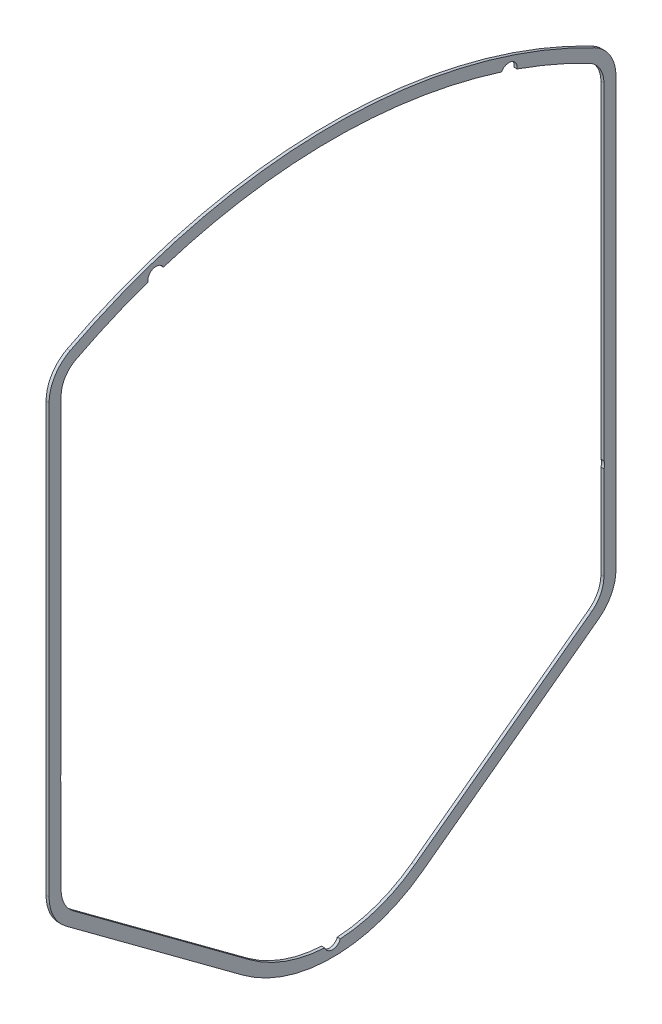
from build123d import *

# Parameters (mm, degrees)
BASE_EXTRUSION_DEPTH = 1


with BuildPart() as part:
    # Esquisse2 → Base-Extrusion (new body)
    with BuildSketch(Plane(origin=(0, 0, 0), x_dir=(0, 0, -1), z_dir=(1, 0, 0))):
        with BuildLine():
            Line((94, 14.412793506), (94, 156.252999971))
            ThreePointArc((94, 156.252999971), (92.108069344, 163.006576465), (86.982954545, 167.794414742))
            ThreePointArc((86.982954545, 167.794414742), (0, 189), (-86.982954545, 167.794414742))
            ThreePointArc((-86.982954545, 167.794414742), (-92.108069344, 163.006576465), (-94, 156.252999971))
            Line((-94, 156.252999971), (-94, 14.412793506))
            ThreePointArc((-94, 14.412793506), (-92.501705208, 8.111415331), (-88.327519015, 3.158797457))
            Line((-88.327519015, 3.158797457), (-29.741139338, -40.192843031))
            ThreePointArc((-29.741139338, -40.192843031), (0, -50), (29.741139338, -40.192843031))
            Line((29.741139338, -40.192843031), (88.327519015, 3.158797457))
            ThreePointArc((88.327519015, 3.158797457), (92.501705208, 8.111415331), (94, 14.412793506))
        make_face()
        with BuildLine():
            Line((27.361848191, -36.977415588), (85.948227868, 6.374224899))
            ThreePointArc((85.948227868, 6.374224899), (88.929789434, 9.911809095), (90, 14.412793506))
            Line((90, 14.412793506), (90, 45.354356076))
            ThreePointArc((90, 45.354356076), (90.25, 46.5), (90, 47.645643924))
            Line((90, 47.645643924), (90, 156.252999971))
            ThreePointArc((90, 156.252999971), (88.690201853, 160.928552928), (85.142045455, 164.243210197))
            ThreePointArc((85.142045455, 164.243210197), (73.361935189, 169.832348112), (61.217406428, 174.577859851))
            ThreePointArc((61.217406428, 174.577859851), (59.37186158, 177.608132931), (56.07500981, 176.296889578))
            ThreePointArc((56.07500981, 176.296889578), (0, 185), (-56.07500981, 176.296889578))
            ThreePointArc((-56.07500981, 176.296889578), (-59.37186158, 177.608132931), (-61.217406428, 174.577859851))
            ThreePointArc((-61.217406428, 174.577859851), (-73.361935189, 169.832348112), (-85.142045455, 164.243210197))
            ThreePointArc((-85.142045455, 164.243210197), (-88.690201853, 160.928552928), (-90, 156.252999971))
            Line((-90, 156.252999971), (-90, 47.645643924))
            ThreePointArc((-90, 47.645643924), (-90.25, 46.5), (-90, 45.354356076))
            Line((-90, 45.354356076), (-90, 14.412793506))
            ThreePointArc((-90, 14.412793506), (-88.929789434, 9.911809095), (-85.948227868, 6.374224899))
            Line((-85.948227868, 6.374224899), (-27.361848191, -36.977415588))
            ThreePointArc((-27.361848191, -36.977415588), (-15.629707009, -43.263289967), (-2.589018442, -45.927083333))
            ThreePointArc((-2.589018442, -45.927083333), (0, -47.75), (2.589018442, -45.927083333))
            ThreePointArc((2.589018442, -45.927083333), (15.629707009, -43.263289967), (27.361848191, -36.977415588))
        make_face(mode=Mode.SUBTRACT)
    extrude(amount=BASE_EXTRUSION_DEPTH)


solid = part.part
